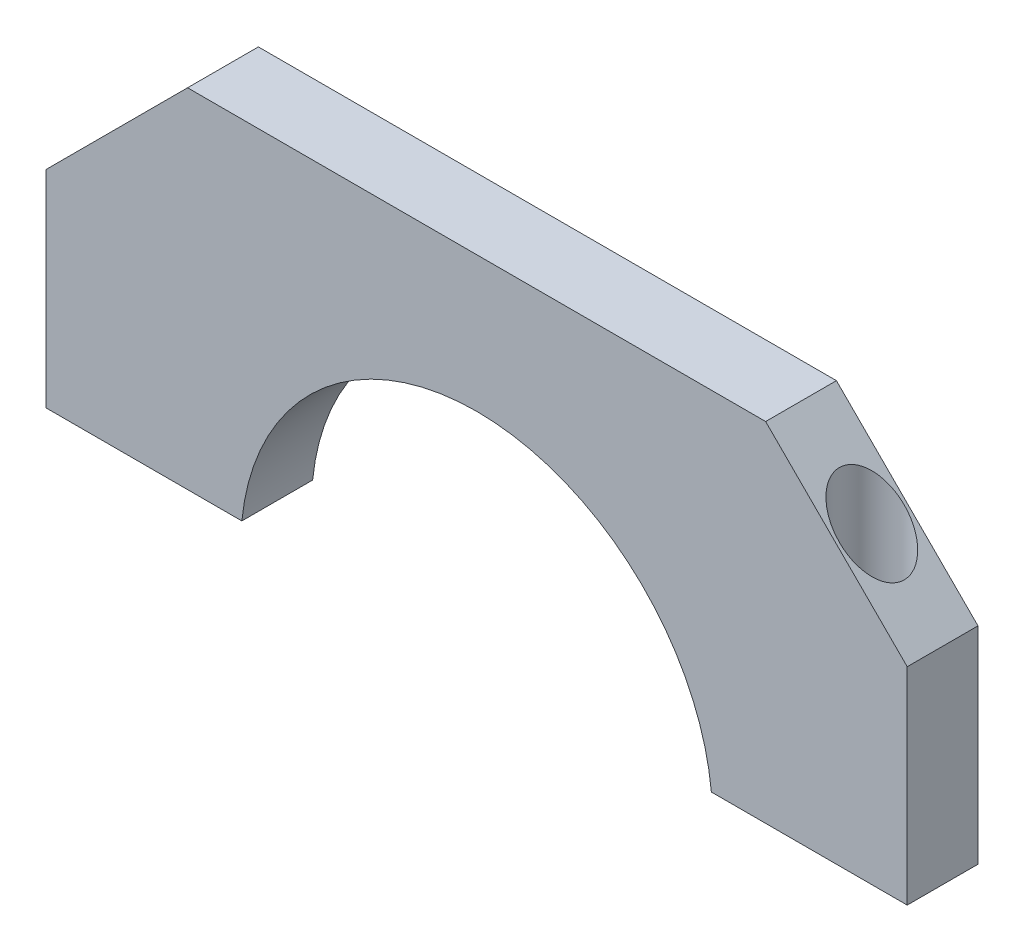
from build123d import *

# Parameters (mm, degrees)
BOSS_EXTRUDE1_DEPTH = 12
SKETCH3_R           = 5.5
CUT_EXTRUDE1_DEPTH  = 39
CUT_EXTRUDE2_REACH  = 85.63
SKETCH5_R           = 3.25


with BuildPart() as part:
    # Sketch1 → Boss-Extrude1 (new body)
    with BuildSketch(Plane.XY):
        with BuildLine():
            Line((-73, 5.5), (-49, 29.5))
            Line((-49, 29.5), (49, 29.5))
            Line((49, 29.5), (73, 5.5))
            Line((73, 5.5), (73, -29.5))
            Line((73, -29.5), (39.799497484, -29.5))
            ThreePointArc((39.799497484, -29.5), (0, 6.5), (-39.799497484, -29.5))
            Line((-39.799497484, -29.5), (-73, -29.5))
            Line((-73, -29.5), (-73, 5.5))
        make_face()
    extrude(amount=BOSS_EXTRUDE1_DEPTH)

    # Sketch3 → Cut-Extrude1 (cut)
    with BuildSketch(Plane(origin=(0, 29.5, 0), x_dir=(1, 0, 0), z_dir=(0, 1, 0))):
        with Locations(Location((-61, -6, 0), (0, 0, 270))):
            Circle(SKETCH3_R)
        with Locations(Location((61, -6, 0), (0, 0, 270))):
            Circle(SKETCH3_R)
    extrude(amount=-CUT_EXTRUDE1_DEPTH, mode=Mode.SUBTRACT)

    # Sketch5 → Cut-Extrude2 (cut, up to next)
    with BuildSketch(Plane(origin=(0, -9.5, 0), x_dir=(1, 0, 0), z_dir=(0, 1, 0)), mode=Mode.PRIVATE) as cut_extrude2_sk1:
        with Locations(Location((61, -6, 0), (0, 0, 270))):
            Circle(SKETCH5_R)
    cut_extrude2_tool1 = extrude(cut_extrude2_sk1.sketch, amount=-CUT_EXTRUDE2_REACH, mode=Mode.PRIVATE) & part.part
    # Sketch5 → Cut-Extrude2 (cut, up to next)
    with BuildSketch(Plane(origin=(0, -9.5, 0), x_dir=(1, 0, 0), z_dir=(0, 1, 0)), mode=Mode.PRIVATE) as cut_extrude2_sk2:
        with Locations(Location((-61, -6, 0), (0, 0, 270))):
            Circle(SKETCH5_R)
    cut_extrude2_tool2 = extrude(cut_extrude2_sk2.sketch, amount=-CUT_EXTRUDE2_REACH, mode=Mode.PRIVATE) & part.part
    add(cut_extrude2_tool1.solids().sort_by_distance((61, -9.5, 6))[0], mode=Mode.SUBTRACT)
    add(cut_extrude2_tool2.solids().sort_by_distance((-61, -9.5, 6))[0], mode=Mode.SUBTRACT)


solid = part.part
